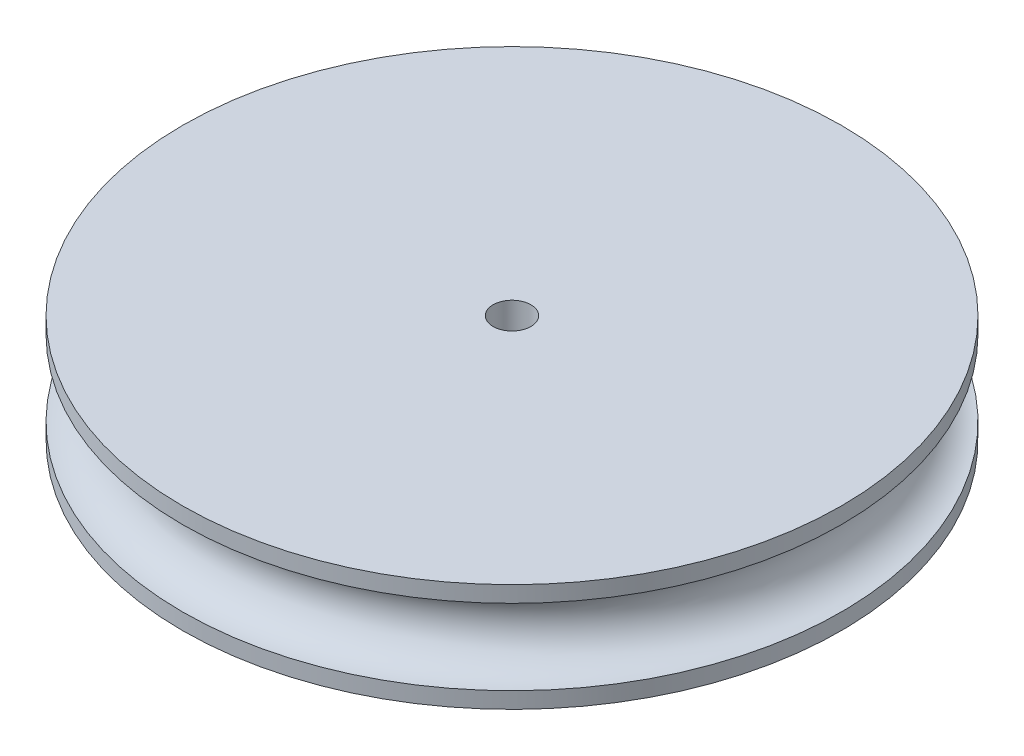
ISO-10303-21;
HEADER;
FILE_DESCRIPTION(('STEP AP214'),'2;1');
FILE_NAME('part.step','',(''),(''),'','','');
FILE_SCHEMA(('AUTOMOTIVE_DESIGN { 1 0 10303 214 1 1 1 1 }'));
ENDSEC;
DATA;
#1=APPLICATION_CONTEXT('core data for automotive mechanical design processes');
#2=APPLICATION_PROTOCOL_DEFINITION('international standard','automotive_design',2000,#1);
#3=PRODUCT_CONTEXT('',#1,'mechanical');
#4=PRODUCT('Part','Part','',(#3));
#5=PRODUCT_RELATED_PRODUCT_CATEGORY('part','',(#4));
#6=PRODUCT_DEFINITION_FORMATION('','',#4);
#7=PRODUCT_DEFINITION_CONTEXT('part definition',#1,'design');
#8=PRODUCT_DEFINITION('design','',#6,#7);
#9=PRODUCT_DEFINITION_SHAPE('','',#8);
#10=(LENGTH_UNIT() NAMED_UNIT(*) SI_UNIT(.MILLI.,.METRE.));
#11=(NAMED_UNIT(*) PLANE_ANGLE_UNIT() SI_UNIT($,.RADIAN.));
#12=(NAMED_UNIT(*) SI_UNIT($,.STERADIAN.) SOLID_ANGLE_UNIT());
#13=UNCERTAINTY_MEASURE_WITH_UNIT(LENGTH_MEASURE(1.E-05),#10,'distance_accuracy_value','');
#14=(GEOMETRIC_REPRESENTATION_CONTEXT(3) GLOBAL_UNCERTAINTY_ASSIGNED_CONTEXT((#13)) GLOBAL_UNIT_ASSIGNED_CONTEXT((#10,
#11,#12)) REPRESENTATION_CONTEXT('',''));
#15=CARTESIAN_POINT('',(0.,0.,0.));
#16=DIRECTION('',(0.,0.,1.));
#17=DIRECTION('',(1.,0.,0.));
#18=AXIS2_PLACEMENT_3D('',#15,#16,#17);
#19=CARTESIAN_POINT('',(0.,32.512,0.));
#20=DIRECTION('',(0.,-1.,0.));
#21=DIRECTION('',(0.,0.,-1.));
#22=AXIS2_PLACEMENT_3D('',#19,#20,#21);
#23=CYLINDRICAL_SURFACE('',#22,15.494);
#24=CARTESIAN_POINT('',(0.,32.512,0.));
#25=DIRECTION('',(0.,1.,0.));
#26=DIRECTION('',(0.,0.,1.));
#27=AXIS2_PLACEMENT_3D('',#24,#25,#26);
#28=CIRCLE('',#27,15.494);
#29=CARTESIAN_POINT('',(0.,32.512,15.494));
#30=VERTEX_POINT('',#29);
#31=EDGE_CURVE('E10',#30,#30,#28,.T.);
#32=ORIENTED_EDGE('',*,*,#31,.F.);
#33=EDGE_LOOP('',(#32));
#34=FACE_BOUND('',#33,.T.);
#35=CARTESIAN_POINT('',(0.,31.75,0.));
#36=DIRECTION('',(0.,-1.,0.));
#37=DIRECTION('',(0.,0.,-1.));
#38=AXIS2_PLACEMENT_3D('',#35,#36,#37);
#39=CIRCLE('',#38,15.494);
#40=CARTESIAN_POINT('',(0.,31.75,-15.494));
#41=VERTEX_POINT('',#40);
#42=EDGE_CURVE('E36',#41,#41,#39,.T.);
#43=ORIENTED_EDGE('',*,*,#42,.F.);
#44=EDGE_LOOP('',(#43));
#45=FACE_BOUND('',#44,.T.);
#46=ADVANCED_FACE('F33',(#34,#45),#23,.T.);
#47=CARTESIAN_POINT('',(0.,27.432,0.));
#48=DIRECTION('',(0.,1.,0.));
#49=DIRECTION('',(0.,0.,1.));
#50=AXIS2_PLACEMENT_3D('',#47,#48,#49);
#51=CIRCLE('',#50,15.494);
#52=CARTESIAN_POINT('',(0.,27.432,15.494));
#53=VERTEX_POINT('',#52);
#54=EDGE_CURVE('E40',#53,#53,#51,.T.);
#55=ORIENTED_EDGE('',*,*,#54,.T.);
#56=EDGE_LOOP('',(#55));
#57=FACE_BOUND('',#56,.T.);
#58=CARTESIAN_POINT('',(0.,28.194,0.));
#59=DIRECTION('',(0.,1.,0.));
#60=DIRECTION('',(0.,0.,1.));
#61=AXIS2_PLACEMENT_3D('',#58,#59,#60);
#62=CIRCLE('',#61,15.494);
#63=CARTESIAN_POINT('',(0.,28.194,15.494));
#64=VERTEX_POINT('',#63);
#65=EDGE_CURVE('E49',#64,#64,#62,.T.);
#66=ORIENTED_EDGE('',*,*,#65,.F.);
#67=EDGE_LOOP('',(#66));
#68=FACE_BOUND('',#67,.T.);
#69=ADVANCED_FACE('F70',(#57,#68),#23,.T.);
#70=CARTESIAN_POINT('',(0.,32.512,0.));
#71=DIRECTION('',(0.,1.,0.));
#72=DIRECTION('',(0.,0.,1.));
#73=AXIS2_PLACEMENT_3D('',#70,#71,#72);
#74=PLANE('',#73);
#75=CARTESIAN_POINT('',(0.,32.512,0.));
#76=DIRECTION('',(0.,-1.,0.));
#77=DIRECTION('',(0.,0.,-1.));
#78=AXIS2_PLACEMENT_3D('',#75,#76,#77);
#79=CIRCLE('',#78,0.889);
#80=CARTESIAN_POINT('',(0.,32.512,-0.889));
#81=VERTEX_POINT('',#80);
#82=EDGE_CURVE('E51',#81,#81,#79,.T.);
#83=ORIENTED_EDGE('',*,*,#82,.T.);
#84=EDGE_LOOP('',(#83));
#85=FACE_BOUND('',#84,.T.);
#86=ORIENTED_EDGE('',*,*,#31,.T.);
#87=EDGE_LOOP('',(#86));
#88=FACE_BOUND('',#87,.T.);
#89=ADVANCED_FACE('F67',(#85,#88),#74,.T.);
#90=CARTESIAN_POINT('',(0.,27.432,0.));
#91=DIRECTION('',(0.,1.,0.));
#92=DIRECTION('',(0.,0.,1.));
#93=AXIS2_PLACEMENT_3D('',#90,#91,#92);
#94=PLANE('',#93);
#95=CARTESIAN_POINT('',(0.,27.432,0.));
#96=DIRECTION('',(0.,-1.,0.));
#97=DIRECTION('',(0.,0.,-1.));
#98=AXIS2_PLACEMENT_3D('',#95,#96,#97);
#99=CIRCLE('',#98,0.889);
#100=CARTESIAN_POINT('',(0.,27.432,-0.889));
#101=VERTEX_POINT('',#100);
#102=EDGE_CURVE('E47',#101,#101,#99,.T.);
#103=ORIENTED_EDGE('',*,*,#102,.F.);
#104=EDGE_LOOP('',(#103));
#105=FACE_BOUND('',#104,.T.);
#106=ORIENTED_EDGE('',*,*,#54,.F.);
#107=EDGE_LOOP('',(#106));
#108=FACE_BOUND('',#107,.T.);
#109=ADVANCED_FACE('F63',(#105,#108),#94,.F.);
#110=CARTESIAN_POINT('',(0.,29.972,0.));
#111=DIRECTION('',(0.,1.,0.));
#112=DIRECTION('',(0.,0.,1.));
#113=AXIS2_PLACEMENT_3D('',#110,#111,#112);
#114=TOROIDAL_SURFACE('',#113,15.494,1.778);
#115=ORIENTED_EDGE('',*,*,#65,.T.);
#116=EDGE_LOOP('',(#115));
#117=FACE_BOUND('',#116,.T.);
#118=ORIENTED_EDGE('',*,*,#42,.T.);
#119=EDGE_LOOP('',(#118));
#120=FACE_BOUND('',#119,.T.);
#121=ADVANCED_FACE('F66',(#117,#120),#114,.F.);
#122=CARTESIAN_POINT('',(0.,32.512,0.));
#123=DIRECTION('',(0.,-1.,0.));
#124=DIRECTION('',(0.,0.,-1.));
#125=AXIS2_PLACEMENT_3D('',#122,#123,#124);
#126=CYLINDRICAL_SURFACE('',#125,0.889);
#127=ORIENTED_EDGE('',*,*,#82,.F.);
#128=EDGE_LOOP('',(#127));
#129=FACE_BOUND('',#128,.T.);
#130=ORIENTED_EDGE('',*,*,#102,.T.);
#131=EDGE_LOOP('',(#130));
#132=FACE_BOUND('',#131,.T.);
#133=ADVANCED_FACE('F61',(#129,#132),#126,.F.);
#134=CLOSED_SHELL('',(#46,#69,#89,#109,#121,#133));
#135=MANIFOLD_SOLID_BREP('B2',#134);
#136=ADVANCED_BREP_SHAPE_REPRESENTATION('',(#18,#135),#14);
#137=SHAPE_DEFINITION_REPRESENTATION(#9,#136);
ENDSEC;
END-ISO-10303-21;
